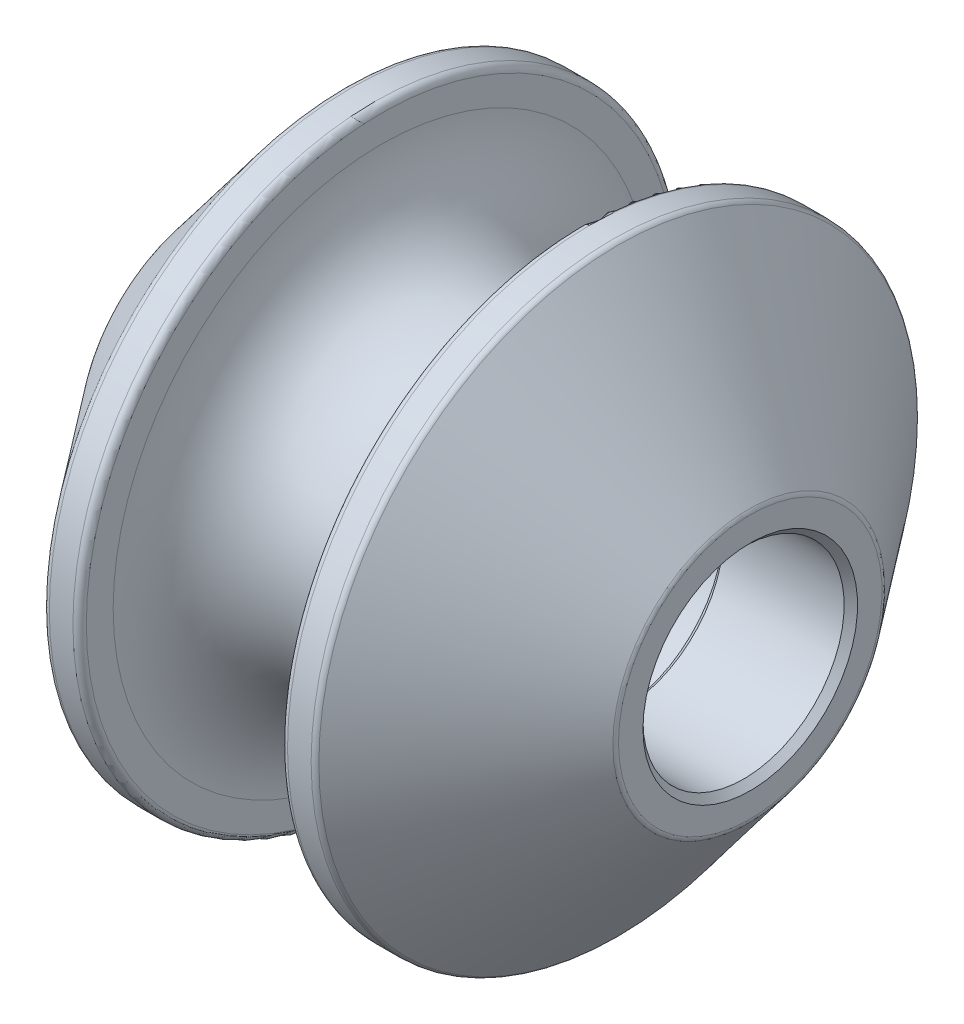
ISO-10303-21;
HEADER;
FILE_DESCRIPTION(('STEP AP214'),'2;1');
FILE_NAME('part.step','',(''),(''),'','','');
FILE_SCHEMA(('AUTOMOTIVE_DESIGN { 1 0 10303 214 1 1 1 1 }'));
ENDSEC;
DATA;
#1=APPLICATION_CONTEXT('core data for automotive mechanical design processes');
#2=APPLICATION_PROTOCOL_DEFINITION('international standard','automotive_design',2000,#1);
#3=PRODUCT_CONTEXT('',#1,'mechanical');
#4=PRODUCT('Part','Part','',(#3));
#5=PRODUCT_RELATED_PRODUCT_CATEGORY('part','',(#4));
#6=PRODUCT_DEFINITION_FORMATION('','',#4);
#7=PRODUCT_DEFINITION_CONTEXT('part definition',#1,'design');
#8=PRODUCT_DEFINITION('design','',#6,#7);
#9=PRODUCT_DEFINITION_SHAPE('','',#8);
#10=(LENGTH_UNIT() NAMED_UNIT(*) SI_UNIT(.MILLI.,.METRE.));
#11=(NAMED_UNIT(*) PLANE_ANGLE_UNIT() SI_UNIT($,.RADIAN.));
#12=(NAMED_UNIT(*) SI_UNIT($,.STERADIAN.) SOLID_ANGLE_UNIT());
#13=UNCERTAINTY_MEASURE_WITH_UNIT(LENGTH_MEASURE(1.E-05),#10,'distance_accuracy_value','');
#14=(GEOMETRIC_REPRESENTATION_CONTEXT(3) GLOBAL_UNCERTAINTY_ASSIGNED_CONTEXT((#13)) GLOBAL_UNIT_ASSIGNED_CONTEXT((#10,
#11,#12)) REPRESENTATION_CONTEXT('',''));
#15=CARTESIAN_POINT('',(0.,0.,0.));
#16=DIRECTION('',(0.,0.,1.));
#17=DIRECTION('',(1.,0.,0.));
#18=AXIS2_PLACEMENT_3D('',#15,#16,#17);
#19=CARTESIAN_POINT('',(-40.,20.,0.));
#20=DIRECTION('',(1.,0.,0.));
#21=DIRECTION('',(0.,0.,-1.));
#22=AXIS2_PLACEMENT_3D('',#19,#20,#21);
#23=PLANE('',#22);
#24=CARTESIAN_POINT('',(-40.,0.,0.));
#25=DIRECTION('',(1.,0.,0.));
#26=DIRECTION('',(0.,0.,-1.));
#27=AXIS2_PLACEMENT_3D('',#24,#25,#26);
#28=CIRCLE('',#27,19.6492189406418);
#29=CARTESIAN_POINT('',(-40.,0.,-19.6492189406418));
#30=VERTEX_POINT('',#29);
#31=EDGE_CURVE('E42',#30,#30,#28,.F.);
#32=ORIENTED_EDGE('',*,*,#31,.T.);
#33=EDGE_LOOP('',(#32));
#34=FACE_BOUND('',#33,.T.);
#35=CARTESIAN_POINT('',(-40.,0.,0.));
#36=DIRECTION('',(1.,0.,0.));
#37=DIRECTION('',(0.,0.,-1.));
#38=AXIS2_PLACEMENT_3D('',#35,#36,#37);
#39=CIRCLE('',#38,16.);
#40=CARTESIAN_POINT('',(-40.,0.,-16.));
#41=VERTEX_POINT('',#40);
#42=EDGE_CURVE('E84',#41,#41,#39,.T.);
#43=ORIENTED_EDGE('',*,*,#42,.T.);
#44=EDGE_LOOP('',(#43));
#45=FACE_BOUND('',#44,.T.);
#46=ADVANCED_FACE('F31',(#34,#45),#23,.F.);
#47=CARTESIAN_POINT('',(-20.,0.,0.));
#48=DIRECTION('',(1.,0.,0.));
#49=DIRECTION('',(0.,0.,-1.));
#50=AXIS2_PLACEMENT_3D('',#47,#48,#49);
#51=CONICAL_SURFACE('',#50,45.,0.896055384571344);
#52=CARTESIAN_POINT('',(-20.3002439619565,0.,0.));
#53=DIRECTION('',(-1.,0.,0.));
#54=DIRECTION('',(0.,0.,1.));
#55=AXIS2_PLACEMENT_3D('',#52,#53,#54);
#56=CIRCLE('',#55,44.6246950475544);
#57=CARTESIAN_POINT('',(-20.3002439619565,0.,44.6246950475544));
#58=VERTEX_POINT('',#57);
#59=EDGE_CURVE('E54',#58,#58,#56,.T.);
#60=ORIENTED_EDGE('',*,*,#59,.T.);
#61=EDGE_LOOP('',(#60));
#62=FACE_BOUND('',#61,.T.);
#63=CARTESIAN_POINT('',(-39.780868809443,0.,0.));
#64=DIRECTION('',(-1.,0.,0.));
#65=DIRECTION('',(0.,0.,1.));
#66=AXIS2_PLACEMENT_3D('',#63,#64,#65);
#67=CIRCLE('',#66,20.2739139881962);
#68=CARTESIAN_POINT('',(-39.780868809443,0.,20.2739139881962));
#69=VERTEX_POINT('',#68);
#70=EDGE_CURVE('E57',#69,#69,#67,.F.);
#71=ORIENTED_EDGE('',*,*,#70,.T.);
#72=EDGE_LOOP('',(#71));
#73=FACE_BOUND('',#72,.T.);
#74=ADVANCED_FACE('F126',(#62,#73),#51,.T.);
#75=CARTESIAN_POINT('',(-40.,0.,0.));
#76=DIRECTION('',(-1.,0.,0.));
#77=DIRECTION('',(0.,0.,1.));
#78=AXIS2_PLACEMENT_3D('',#75,#76,#77);
#79=CYLINDRICAL_SURFACE('',#78,45.);
#80=CARTESIAN_POINT('',(-19.5193751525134,0.,0.));
#81=DIRECTION('',(1.,0.,0.));
#82=DIRECTION('',(0.,0.,-1.));
#83=AXIS2_PLACEMENT_3D('',#80,#81,#82);
#84=CIRCLE('',#83,45.);
#85=CARTESIAN_POINT('',(-19.5193751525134,0.,-45.));
#86=VERTEX_POINT('',#85);
#87=EDGE_CURVE('E46',#86,#86,#84,.T.);
#88=ORIENTED_EDGE('',*,*,#87,.T.);
#89=EDGE_LOOP('',(#88));
#90=FACE_BOUND('',#89,.T.);
#91=CARTESIAN_POINT('',(-16.,0.,0.));
#92=DIRECTION('',(-1.,0.,0.));
#93=DIRECTION('',(0.,0.,1.));
#94=AXIS2_PLACEMENT_3D('',#91,#92,#93);
#95=CIRCLE('',#94,45.);
#96=CARTESIAN_POINT('',(-16.,0.,45.));
#97=VERTEX_POINT('',#96);
#98=EDGE_CURVE('E51',#97,#97,#95,.T.);
#99=ORIENTED_EDGE('',*,*,#98,.T.);
#100=EDGE_LOOP('',(#99));
#101=FACE_BOUND('',#100,.T.);
#102=ADVANCED_FACE('F132',(#90,#101),#79,.T.);
#103=CARTESIAN_POINT('',(-15.,40.,0.));
#104=DIRECTION('',(-1.,0.,0.));
#105=DIRECTION('',(0.,0.,1.));
#106=AXIS2_PLACEMENT_3D('',#103,#104,#105);
#107=PLANE('',#106);
#108=CARTESIAN_POINT('',(-15.,0.,0.));
#109=DIRECTION('',(-1.,0.,0.));
#110=DIRECTION('',(0.,0.,1.));
#111=AXIS2_PLACEMENT_3D('',#108,#109,#110);
#112=CIRCLE('',#111,44.);
#113=CARTESIAN_POINT('',(-15.,0.,44.));
#114=VERTEX_POINT('',#113);
#115=EDGE_CURVE('E10',#114,#114,#112,.F.);
#116=ORIENTED_EDGE('',*,*,#115,.T.);
#117=EDGE_LOOP('',(#116));
#118=FACE_BOUND('',#117,.T.);
#119=CARTESIAN_POINT('',(-15.,0.,0.));
#120=DIRECTION('',(-1.,0.,0.));
#121=DIRECTION('',(0.,0.,1.));
#122=AXIS2_PLACEMENT_3D('',#119,#120,#121);
#123=CIRCLE('',#122,40.);
#124=CARTESIAN_POINT('',(-15.,0.,40.));
#125=VERTEX_POINT('',#124);
#126=EDGE_CURVE('E93',#125,#125,#123,.T.);
#127=ORIENTED_EDGE('',*,*,#126,.T.);
#128=EDGE_LOOP('',(#127));
#129=FACE_BOUND('',#128,.T.);
#130=ADVANCED_FACE('F139',(#118,#129),#107,.F.);
#131=CARTESIAN_POINT('',(0.,0.,0.));
#132=DIRECTION('',(-1.,0.,0.));
#133=DIRECTION('',(0.,0.,1.));
#134=AXIS2_PLACEMENT_3D('',#131,#132,#133);
#135=TOROIDAL_SURFACE('',#134,40.,15.);
#136=ORIENTED_EDGE('',*,*,#126,.F.);
#137=EDGE_LOOP('',(#136));
#138=FACE_BOUND('',#137,.T.);
#139=CARTESIAN_POINT('',(15.,0.,0.));
#140=DIRECTION('',(-1.,0.,0.));
#141=DIRECTION('',(0.,0.,1.));
#142=AXIS2_PLACEMENT_3D('',#139,#140,#141);
#143=CIRCLE('',#142,40.);
#144=CARTESIAN_POINT('',(15.,0.,40.));
#145=VERTEX_POINT('',#144);
#146=EDGE_CURVE('E96',#145,#145,#143,.T.);
#147=ORIENTED_EDGE('',*,*,#146,.T.);
#148=EDGE_LOOP('',(#147));
#149=FACE_BOUND('',#148,.T.);
#150=ADVANCED_FACE('F143',(#138,#149),#135,.F.);
#151=CARTESIAN_POINT('',(15.,40.,0.));
#152=DIRECTION('',(1.,0.,0.));
#153=DIRECTION('',(0.,0.,-1.));
#154=AXIS2_PLACEMENT_3D('',#151,#152,#153);
#155=PLANE('',#154);
#156=CARTESIAN_POINT('',(15.,0.,0.));
#157=DIRECTION('',(1.,0.,0.));
#158=DIRECTION('',(0.,0.,-1.));
#159=AXIS2_PLACEMENT_3D('',#156,#157,#158);
#160=CIRCLE('',#159,44.);
#161=CARTESIAN_POINT('',(15.,0.,-44.));
#162=VERTEX_POINT('',#161);
#163=EDGE_CURVE('E38',#162,#162,#160,.F.);
#164=ORIENTED_EDGE('',*,*,#163,.T.);
#165=EDGE_LOOP('',(#164));
#166=FACE_BOUND('',#165,.T.);
#167=ORIENTED_EDGE('',*,*,#146,.F.);
#168=EDGE_LOOP('',(#167));
#169=FACE_BOUND('',#168,.T.);
#170=ADVANCED_FACE('F146',(#166,#169),#155,.F.);
#171=CARTESIAN_POINT('',(-40.,0.,0.));
#172=DIRECTION('',(-1.,0.,0.));
#173=DIRECTION('',(0.,0.,1.));
#174=AXIS2_PLACEMENT_3D('',#171,#172,#173);
#175=CYLINDRICAL_SURFACE('',#174,45.);
#176=CARTESIAN_POINT('',(19.5193751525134,0.,0.));
#177=DIRECTION('',(1.,0.,0.));
#178=DIRECTION('',(0.,0.,-1.));
#179=AXIS2_PLACEMENT_3D('',#176,#177,#178);
#180=CIRCLE('',#179,45.);
#181=CARTESIAN_POINT('',(19.5193751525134,0.,-45.));
#182=VERTEX_POINT('',#181);
#183=EDGE_CURVE('E60',#182,#182,#180,.F.);
#184=ORIENTED_EDGE('',*,*,#183,.T.);
#185=EDGE_LOOP('',(#184));
#186=FACE_BOUND('',#185,.T.);
#187=CARTESIAN_POINT('',(16.,0.,0.));
#188=DIRECTION('',(1.,0.,0.));
#189=DIRECTION('',(0.,0.,-1.));
#190=AXIS2_PLACEMENT_3D('',#187,#188,#189);
#191=CIRCLE('',#190,45.);
#192=CARTESIAN_POINT('',(16.,0.,-45.));
#193=VERTEX_POINT('',#192);
#194=EDGE_CURVE('E63',#193,#193,#191,.T.);
#195=ORIENTED_EDGE('',*,*,#194,.T.);
#196=EDGE_LOOP('',(#195));
#197=FACE_BOUND('',#196,.T.);
#198=ADVANCED_FACE('F150',(#186,#197),#175,.T.);
#199=CARTESIAN_POINT('',(40.,0.,0.));
#200=DIRECTION('',(-1.,0.,0.));
#201=DIRECTION('',(0.,0.,1.));
#202=AXIS2_PLACEMENT_3D('',#199,#200,#201);
#203=CONICAL_SURFACE('',#202,20.,0.896055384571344);
#204=CARTESIAN_POINT('',(39.780868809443,0.,0.));
#205=DIRECTION('',(1.,0.,0.));
#206=DIRECTION('',(0.,0.,-1.));
#207=AXIS2_PLACEMENT_3D('',#204,#205,#206);
#208=CIRCLE('',#207,20.2739139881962);
#209=CARTESIAN_POINT('',(39.780868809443,0.,-20.2739139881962));
#210=VERTEX_POINT('',#209);
#211=EDGE_CURVE('E69',#210,#210,#208,.F.);
#212=ORIENTED_EDGE('',*,*,#211,.T.);
#213=EDGE_LOOP('',(#212));
#214=FACE_BOUND('',#213,.T.);
#215=CARTESIAN_POINT('',(20.3002439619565,0.,0.));
#216=DIRECTION('',(1.,0.,0.));
#217=DIRECTION('',(0.,0.,-1.));
#218=AXIS2_PLACEMENT_3D('',#215,#216,#217);
#219=CIRCLE('',#218,44.6246950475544);
#220=CARTESIAN_POINT('',(20.3002439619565,0.,-44.6246950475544));
#221=VERTEX_POINT('',#220);
#222=EDGE_CURVE('E72',#221,#221,#219,.T.);
#223=ORIENTED_EDGE('',*,*,#222,.T.);
#224=EDGE_LOOP('',(#223));
#225=FACE_BOUND('',#224,.T.);
#226=ADVANCED_FACE('F153',(#214,#225),#203,.T.);
#227=CARTESIAN_POINT('',(40.,15.,0.));
#228=DIRECTION('',(-1.,0.,0.));
#229=DIRECTION('',(0.,0.,1.));
#230=AXIS2_PLACEMENT_3D('',#227,#228,#229);
#231=PLANE('',#230);
#232=CARTESIAN_POINT('',(40.,0.,0.));
#233=DIRECTION('',(-1.,0.,0.));
#234=DIRECTION('',(0.,0.,1.));
#235=AXIS2_PLACEMENT_3D('',#232,#233,#234);
#236=CIRCLE('',#235,19.6492189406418);
#237=CARTESIAN_POINT('',(40.,0.,19.6492189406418));
#238=VERTEX_POINT('',#237);
#239=EDGE_CURVE('E66',#238,#238,#236,.F.);
#240=ORIENTED_EDGE('',*,*,#239,.T.);
#241=EDGE_LOOP('',(#240));
#242=FACE_BOUND('',#241,.T.);
#243=CARTESIAN_POINT('',(40.,0.,0.));
#244=DIRECTION('',(-1.,0.,0.));
#245=DIRECTION('',(0.,0.,1.));
#246=AXIS2_PLACEMENT_3D('',#243,#244,#245);
#247=CIRCLE('',#246,16.);
#248=CARTESIAN_POINT('',(40.,0.,16.));
#249=VERTEX_POINT('',#248);
#250=EDGE_CURVE('E75',#249,#249,#247,.T.);
#251=ORIENTED_EDGE('',*,*,#250,.T.);
#252=EDGE_LOOP('',(#251));
#253=FACE_BOUND('',#252,.T.);
#254=ADVANCED_FACE('F157',(#242,#253),#231,.F.);
#255=CARTESIAN_POINT('',(-40.,0.,0.));
#256=DIRECTION('',(-1.,0.,0.));
#257=DIRECTION('',(0.,0.,1.));
#258=AXIS2_PLACEMENT_3D('',#255,#256,#257);
#259=CYLINDRICAL_SURFACE('',#258,15.);
#260=CARTESIAN_POINT('',(21.,0.,0.));
#261=DIRECTION('',(1.,0.,0.));
#262=DIRECTION('',(0.,0.,-1.));
#263=AXIS2_PLACEMENT_3D('',#260,#261,#262);
#264=CIRCLE('',#263,15.);
#265=CARTESIAN_POINT('',(21.,0.,-15.));
#266=VERTEX_POINT('',#265);
#267=EDGE_CURVE('E78',#266,#266,#264,.F.);
#268=ORIENTED_EDGE('',*,*,#267,.T.);
#269=EDGE_LOOP('',(#268));
#270=FACE_BOUND('',#269,.T.);
#271=CARTESIAN_POINT('',(39.,0.,0.));
#272=DIRECTION('',(-1.,0.,0.));
#273=DIRECTION('',(0.,0.,1.));
#274=AXIS2_PLACEMENT_3D('',#271,#272,#273);
#275=CIRCLE('',#274,15.);
#276=CARTESIAN_POINT('',(39.,0.,15.));
#277=VERTEX_POINT('',#276);
#278=EDGE_CURVE('E81',#277,#277,#275,.F.);
#279=ORIENTED_EDGE('',*,*,#278,.T.);
#280=EDGE_LOOP('',(#279));
#281=FACE_BOUND('',#280,.T.);
#282=ADVANCED_FACE('F161',(#270,#281),#259,.F.);
#283=CARTESIAN_POINT('',(-40.,0.,0.));
#284=DIRECTION('',(-1.,0.,0.));
#285=DIRECTION('',(0.,0.,1.));
#286=AXIS2_PLACEMENT_3D('',#283,#284,#285);
#287=CYLINDRICAL_SURFACE('',#286,16.);
#288=CARTESIAN_POINT('',(20.,0.,0.));
#289=DIRECTION('',(-1.,0.,0.));
#290=DIRECTION('',(0.,0.,1.));
#291=AXIS2_PLACEMENT_3D('',#288,#289,#290);
#292=CIRCLE('',#291,16.);
#293=CARTESIAN_POINT('',(20.,0.,16.));
#294=VERTEX_POINT('',#293);
#295=EDGE_CURVE('E99',#294,#294,#292,.T.);
#296=ORIENTED_EDGE('',*,*,#295,.F.);
#297=EDGE_LOOP('',(#296));
#298=FACE_BOUND('',#297,.T.);
#299=CARTESIAN_POINT('',(-20.,0.,0.));
#300=DIRECTION('',(-1.,0.,0.));
#301=DIRECTION('',(0.,0.,1.));
#302=AXIS2_PLACEMENT_3D('',#299,#300,#301);
#303=CIRCLE('',#302,16.);
#304=CARTESIAN_POINT('',(-20.,0.,16.));
#305=VERTEX_POINT('',#304);
#306=EDGE_CURVE('E102',#305,#305,#303,.T.);
#307=ORIENTED_EDGE('',*,*,#306,.T.);
#308=EDGE_LOOP('',(#307));
#309=FACE_BOUND('',#308,.T.);
#310=ADVANCED_FACE('F106',(#298,#309),#287,.F.);
#311=CARTESIAN_POINT('',(-40.,0.,0.));
#312=DIRECTION('',(-1.,0.,0.));
#313=DIRECTION('',(0.,0.,1.));
#314=AXIS2_PLACEMENT_3D('',#311,#312,#313);
#315=CYLINDRICAL_SURFACE('',#314,15.);
#316=CARTESIAN_POINT('',(-39.,0.,0.));
#317=DIRECTION('',(1.,0.,0.));
#318=DIRECTION('',(0.,0.,-1.));
#319=AXIS2_PLACEMENT_3D('',#316,#317,#318);
#320=CIRCLE('',#319,15.);
#321=CARTESIAN_POINT('',(-39.,0.,-15.));
#322=VERTEX_POINT('',#321);
#323=EDGE_CURVE('E87',#322,#322,#320,.F.);
#324=ORIENTED_EDGE('',*,*,#323,.T.);
#325=EDGE_LOOP('',(#324));
#326=FACE_BOUND('',#325,.T.);
#327=CARTESIAN_POINT('',(-21.,0.,0.));
#328=DIRECTION('',(-1.,0.,0.));
#329=DIRECTION('',(0.,0.,1.));
#330=AXIS2_PLACEMENT_3D('',#327,#328,#329);
#331=CIRCLE('',#330,15.);
#332=CARTESIAN_POINT('',(-21.,0.,15.));
#333=VERTEX_POINT('',#332);
#334=EDGE_CURVE('E90',#333,#333,#331,.F.);
#335=ORIENTED_EDGE('',*,*,#334,.T.);
#336=EDGE_LOOP('',(#335));
#337=FACE_BOUND('',#336,.T.);
#338=ADVANCED_FACE('F121',(#326,#337),#315,.F.);
#339=CARTESIAN_POINT('',(-39.,0.,0.));
#340=DIRECTION('',(-1.,0.,0.));
#341=DIRECTION('',(0.,0.,1.));
#342=AXIS2_PLACEMENT_3D('',#339,#340,#341);
#343=CONICAL_SURFACE('',#342,15.,0.785398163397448);
#344=ORIENTED_EDGE('',*,*,#42,.F.);
#345=EDGE_LOOP('',(#344));
#346=FACE_BOUND('',#345,.T.);
#347=ORIENTED_EDGE('',*,*,#323,.F.);
#348=EDGE_LOOP('',(#347));
#349=FACE_BOUND('',#348,.T.);
#350=ADVANCED_FACE('F111',(#346,#349),#343,.F.);
#351=CARTESIAN_POINT('',(-20.,0.,0.));
#352=DIRECTION('',(1.,0.,0.));
#353=DIRECTION('',(0.,0.,-1.));
#354=AXIS2_PLACEMENT_3D('',#351,#352,#353);
#355=CONICAL_SURFACE('',#354,16.,0.785398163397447);
#356=ORIENTED_EDGE('',*,*,#334,.F.);
#357=EDGE_LOOP('',(#356));
#358=FACE_BOUND('',#357,.T.);
#359=ORIENTED_EDGE('',*,*,#306,.F.);
#360=EDGE_LOOP('',(#359));
#361=FACE_BOUND('',#360,.T.);
#362=ADVANCED_FACE('F108',(#358,#361),#355,.F.);
#363=CARTESIAN_POINT('',(21.,0.,0.));
#364=DIRECTION('',(-1.,0.,0.));
#365=DIRECTION('',(0.,0.,1.));
#366=AXIS2_PLACEMENT_3D('',#363,#364,#365);
#367=CONICAL_SURFACE('',#366,15.,0.785398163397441);
#368=ORIENTED_EDGE('',*,*,#295,.T.);
#369=EDGE_LOOP('',(#368));
#370=FACE_BOUND('',#369,.T.);
#371=ORIENTED_EDGE('',*,*,#267,.F.);
#372=EDGE_LOOP('',(#371));
#373=FACE_BOUND('',#372,.T.);
#374=ADVANCED_FACE('F110',(#370,#373),#367,.F.);
#375=CARTESIAN_POINT('',(40.,0.,0.));
#376=DIRECTION('',(1.,0.,0.));
#377=DIRECTION('',(0.,0.,-1.));
#378=AXIS2_PLACEMENT_3D('',#375,#376,#377);
#379=CONICAL_SURFACE('',#378,16.,0.785398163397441);
#380=ORIENTED_EDGE('',*,*,#278,.F.);
#381=EDGE_LOOP('',(#380));
#382=FACE_BOUND('',#381,.T.);
#383=ORIENTED_EDGE('',*,*,#250,.F.);
#384=EDGE_LOOP('',(#383));
#385=FACE_BOUND('',#384,.T.);
#386=ADVANCED_FACE('F118',(#382,#385),#379,.F.);
#387=CARTESIAN_POINT('',(39.,0.,0.));
#388=DIRECTION('',(-1.,0.,0.));
#389=DIRECTION('',(0.,0.,1.));
#390=AXIS2_PLACEMENT_3D('',#387,#388,#389);
#391=TOROIDAL_SURFACE('',#390,19.6492189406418,1.);
#392=ORIENTED_EDGE('',*,*,#239,.F.);
#393=EDGE_LOOP('',(#392));
#394=FACE_BOUND('',#393,.T.);
#395=ORIENTED_EDGE('',*,*,#211,.F.);
#396=EDGE_LOOP('',(#395));
#397=FACE_BOUND('',#396,.T.);
#398=ADVANCED_FACE('F201',(#394,#397),#391,.T.);
#399=CARTESIAN_POINT('',(19.5193751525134,0.,0.));
#400=DIRECTION('',(1.,0.,0.));
#401=DIRECTION('',(0.,0.,-1.));
#402=AXIS2_PLACEMENT_3D('',#399,#400,#401);
#403=TOROIDAL_SURFACE('',#402,44.,1.);
#404=ORIENTED_EDGE('',*,*,#222,.F.);
#405=EDGE_LOOP('',(#404));
#406=FACE_BOUND('',#405,.T.);
#407=ORIENTED_EDGE('',*,*,#183,.F.);
#408=EDGE_LOOP('',(#407));
#409=FACE_BOUND('',#408,.T.);
#410=ADVANCED_FACE('F260',(#406,#409),#403,.T.);
#411=CARTESIAN_POINT('',(-19.5193751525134,0.,0.));
#412=DIRECTION('',(1.,0.,0.));
#413=DIRECTION('',(0.,0.,-1.));
#414=AXIS2_PLACEMENT_3D('',#411,#412,#413);
#415=TOROIDAL_SURFACE('',#414,44.,1.);
#416=ORIENTED_EDGE('',*,*,#87,.F.);
#417=EDGE_LOOP('',(#416));
#418=FACE_BOUND('',#417,.T.);
#419=ORIENTED_EDGE('',*,*,#59,.F.);
#420=EDGE_LOOP('',(#419));
#421=FACE_BOUND('',#420,.T.);
#422=ADVANCED_FACE('F270',(#418,#421),#415,.T.);
#423=CARTESIAN_POINT('',(-39.,0.,0.));
#424=DIRECTION('',(1.,0.,0.));
#425=DIRECTION('',(0.,0.,-1.));
#426=AXIS2_PLACEMENT_3D('',#423,#424,#425);
#427=TOROIDAL_SURFACE('',#426,19.6492189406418,1.);
#428=ORIENTED_EDGE('',*,*,#70,.F.);
#429=EDGE_LOOP('',(#428));
#430=FACE_BOUND('',#429,.T.);
#431=ORIENTED_EDGE('',*,*,#31,.F.);
#432=EDGE_LOOP('',(#431));
#433=FACE_BOUND('',#432,.T.);
#434=ADVANCED_FACE('F280',(#430,#433),#427,.T.);
#435=CARTESIAN_POINT('',(16.,0.,0.));
#436=DIRECTION('',(1.,0.,0.));
#437=DIRECTION('',(0.,0.,-1.));
#438=AXIS2_PLACEMENT_3D('',#435,#436,#437);
#439=TOROIDAL_SURFACE('',#438,44.,1.);
#440=ORIENTED_EDGE('',*,*,#194,.F.);
#441=EDGE_LOOP('',(#440));
#442=FACE_BOUND('',#441,.T.);
#443=ORIENTED_EDGE('',*,*,#163,.F.);
#444=EDGE_LOOP('',(#443));
#445=FACE_BOUND('',#444,.T.);
#446=ADVANCED_FACE('F290',(#442,#445),#439,.T.);
#447=CARTESIAN_POINT('',(-16.,0.,0.));
#448=DIRECTION('',(-1.,0.,0.));
#449=DIRECTION('',(0.,0.,1.));
#450=AXIS2_PLACEMENT_3D('',#447,#448,#449);
#451=TOROIDAL_SURFACE('',#450,44.,1.);
#452=ORIENTED_EDGE('',*,*,#115,.F.);
#453=EDGE_LOOP('',(#452));
#454=FACE_BOUND('',#453,.T.);
#455=ORIENTED_EDGE('',*,*,#98,.F.);
#456=EDGE_LOOP('',(#455));
#457=FACE_BOUND('',#456,.T.);
#458=ADVANCED_FACE('F33',(#454,#457),#451,.T.);
#459=CLOSED_SHELL('',(#46,#74,#102,#130,#150,#170,#198,#226,#254,#282,#310,#338,#350,#362,#374,
#386,#398,#410,#422,#434,#446,#458));
#460=MANIFOLD_SOLID_BREP('B2',#459);
#461=ADVANCED_BREP_SHAPE_REPRESENTATION('',(#18,#460),#14);
#462=SHAPE_DEFINITION_REPRESENTATION(#9,#461);
ENDSEC;
END-ISO-10303-21;
